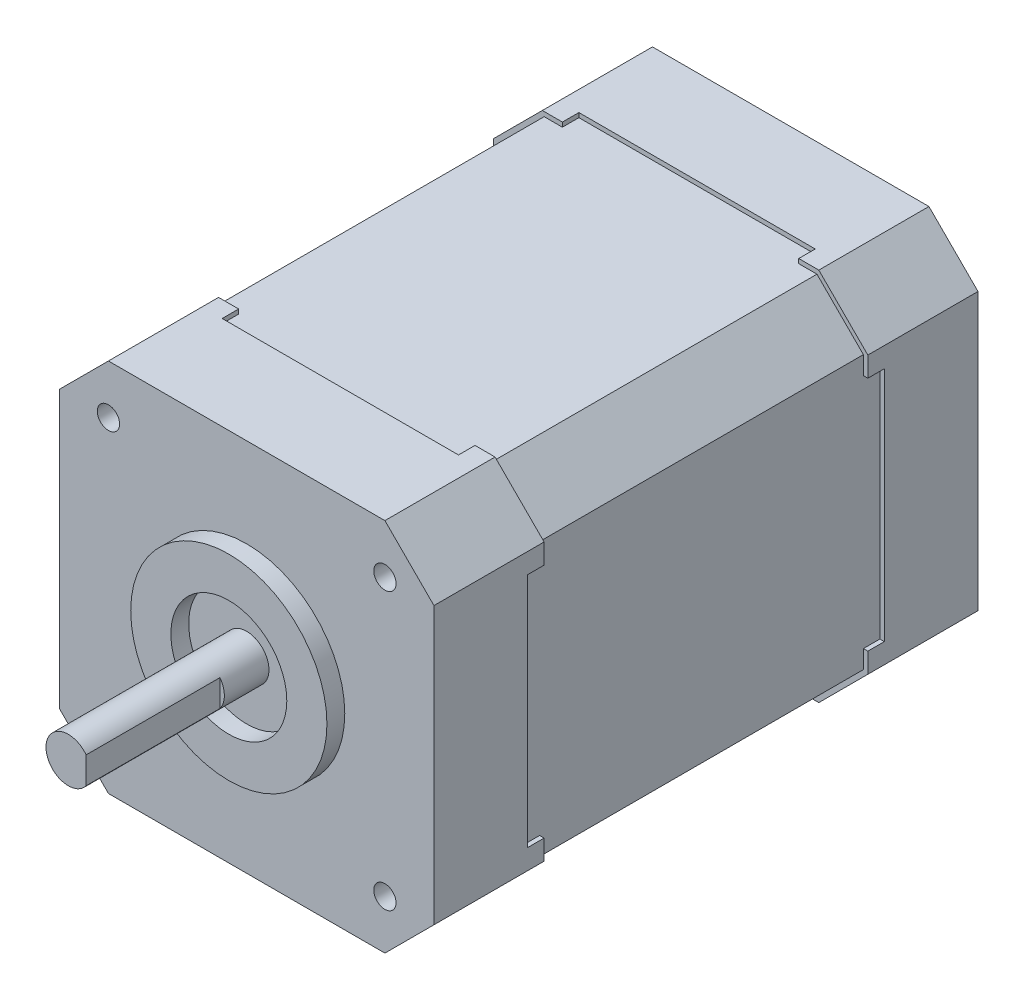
from build123d import *

# Parameters (mm, degrees)
EXTRUDE_1_DEPTH        = 61
SKETCH_2_R             = 11
SKETCH_2_R_2           = 6.5
EXTRUDE_2_DEPTH        = 2
SKETCH_3_R             = 2.5
EXTRUDE_3_DEPTH        = 20
CUT_EXTRUDE_START      = -15
CUT_EXTRUDE_1_DEPTH    = 15
SKETCH_6_W             = 36.3
SKETCH_6_H             = 0.5
CUT_EXTRUDE_START_2    = -0.5
SKETCH_7_W             = 26.5
SKETCH_7_H             = 40
CUT_EXTRUDE_2_DEPTH    = 0.5
SKETCH_8_W             = 40
SKETCH_8_H             = 26.5
CUT_EXTRUDE_3_DEPTH    = 0.5
SKETCH_9_W             = 26.5
SKETCH_9_H             = 40
CUT_EXTRUDE_4_DEPTH    = 0.5
SKETCH_10_W            = 40
SKETCH_10_H            = 26.5
CUT_EXTRUDE_5_DEPTH    = 0.5
HOLE_WIZARD_M3_1_D     = 2.5
HOLE_WIZARD_M3_1_DEPTH = 4.5
HOLE_WIZARD_M3_1_TIP   = 0.751075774


with BuildPart() as part:
    # Sketch 1 → Extrude 1 (new body)
    with BuildSketch(Plane.XY):
        Polygon((-21, 15.5), (-15.5, 21), (15.5, 21), (21, 15.5), (21, -15.5), (15.5, -21), (-15.5, -21), (-21, -15.5), align=None)
    extrude(amount=-EXTRUDE_1_DEPTH)

    # Sketch 2 → Extrude 2 (add)
    with BuildSketch(Plane.XY):
        with Locations(Location((0, 0, 0), (0, 0, 180))):
            Circle(SKETCH_2_R)
        Circle(SKETCH_2_R_2, mode=Mode.SUBTRACT)
    extrude(amount=EXTRUDE_2_DEPTH)

    # Sketch 3 → Extrude 3 (add)
    with BuildSketch(Plane.XY):
        with Locations(Location((0, 0, 0), (0, 0, 180))):
            Circle(SKETCH_3_R)
    extrude(amount=EXTRUDE_3_DEPTH)

    # Sketch 4 → Cut-Extrude 1 (cut)
    with BuildSketch(Plane.XY.offset(20).offset(CUT_EXTRUDE_START)):
        with BuildLine():
            Line((2, 1.5), (2, -1.5))
            ThreePointArc((2, -1.5), (2.5, 0), (2, 1.5))
        make_face()
    extrude(amount=CUT_EXTRUDE_1_DEPTH, mode=Mode.SUBTRACT)

    # Sweep 1: sweep along a path in Sketch 5
    with BuildLine(Plane.XY.offset(-12.35)) as sweep_1_path:
        Line((15.5, 21), (-15.5, 21))
        Line((-15.5, 21), (-21, 15.5))
        Line((-21, 15.5), (-21, -15.5))
        Line((-21, -15.5), (-15.5, -21))
        Line((-15.5, -21), (15.5, -21))
        Line((15.5, -21), (21, -15.5))
        Line((21, -15.5), (21, 15.5))
        Line((21, 15.5), (15.5, 21))
    # Sketch 6 → Sweep 1 (sweep, cut)
    with BuildSketch(Plane(origin=(0, 0, 0), x_dir=(0, 0, -1), z_dir=(1, 0, 0))):
        with Locations((30.5, 20.75)):
            Rectangle(SKETCH_6_W, SKETCH_6_H)
    sweep(path=sweep_1_path.line, transition=Transition.RIGHT, mode=Mode.SUBTRACT)

    # Sketch 7 → Cut-Extrude 2 (cut)
    with BuildSketch(Plane(origin=(0, 21, 0), x_dir=(1, 0, 0), z_dir=(0, 1, 0)).offset(CUT_EXTRUDE_START_2)):
        with Locations((0, 30.5)):
            Rectangle(SKETCH_7_W, SKETCH_7_H)
    extrude(amount=CUT_EXTRUDE_2_DEPTH, mode=Mode.SUBTRACT)

    # Sketch 8 → Cut-Extrude 3 (cut)
    with BuildSketch(Plane(origin=(21, 0, 0), x_dir=(0, 0, -1), z_dir=(1, 0, 0))):
        with Locations((30.5, 0)):
            Rectangle(SKETCH_8_W, SKETCH_8_H)
    extrude(amount=-CUT_EXTRUDE_3_DEPTH, mode=Mode.SUBTRACT)

    # Sketch 9 → Cut-Extrude 4 (cut)
    with BuildSketch(Plane.XZ.offset(21)):
        with Locations((0, -30.5)):
            Rectangle(SKETCH_9_W, SKETCH_9_H)
    extrude(amount=-CUT_EXTRUDE_4_DEPTH, mode=Mode.SUBTRACT)

    # Sketch 10 → Cut-Extrude 5 (cut)
    with BuildSketch(Plane.ZY.offset(21)):
        with Locations((-30.5, 0)):
            Rectangle(SKETCH_10_W, SKETCH_10_H)
    extrude(amount=-CUT_EXTRUDE_5_DEPTH, mode=Mode.SUBTRACT)

    # Hole Wizard M3 _1
    with Locations(Plane.XY):
        with Locations((-15.5, 15.5), (15.5, 15.5), (15.5, -15.5), (-15.5, -15.5)):
            Hole(HOLE_WIZARD_M3_1_D / 2, depth=HOLE_WIZARD_M3_1_DEPTH)
            with Locations((0, 0, -(HOLE_WIZARD_M3_1_DEPTH + HOLE_WIZARD_M3_1_TIP / 2))):  # 118° drill point
                Cone(0, HOLE_WIZARD_M3_1_D / 2, HOLE_WIZARD_M3_1_TIP, mode=Mode.SUBTRACT)


solid = part.part
